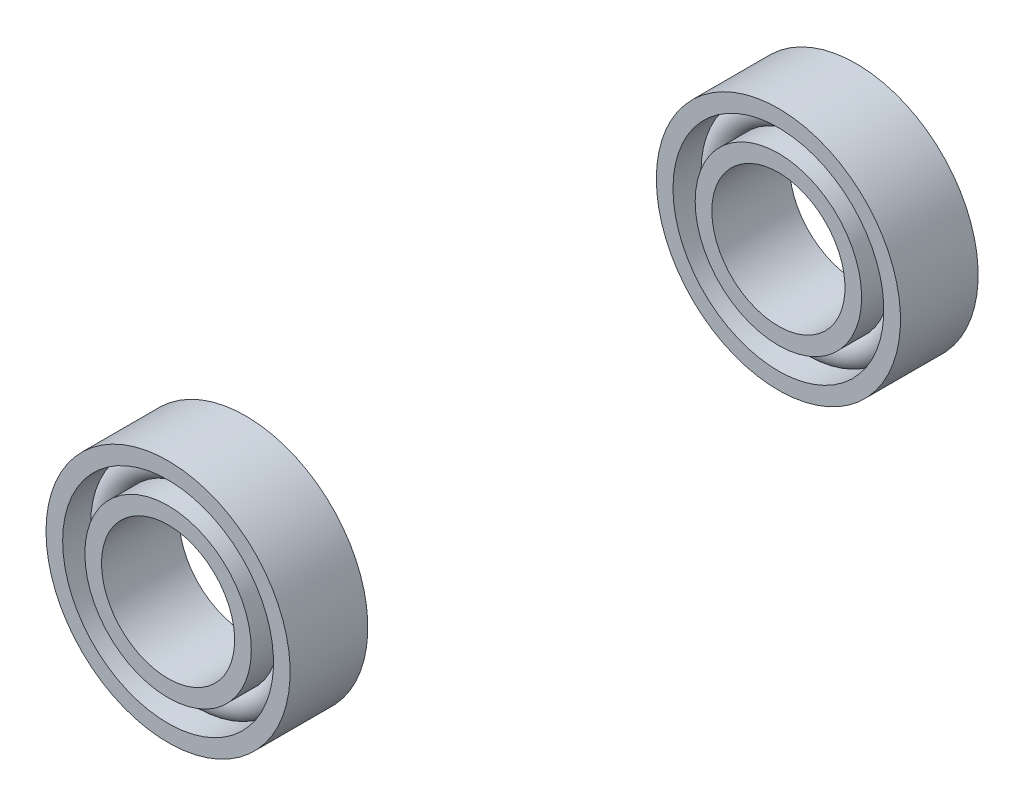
from build123d import *

# Parameters (mm, degrees)
SK_PISTA_INT_1_W = 1.5
SK_PISTA_INT_1_H = 7
SK_PISTA_EXT_1_W = 1.5
SK_PISTA_EXT_1_H = 7
SK_BOLAS_1_R     = 1.4
SK_PISTA_INT_2_W = 1.5
SK_PISTA_INT_2_H = 7
SK_PISTA_EXT_2_W = 1.5
SK_PISTA_EXT_2_H = 7
SK_BOLAS_2_R     = 1.4


with BuildPart() as part:
    # Sk_Pista_int_1 → Pista_int_1 (revolve)
    with BuildSketch(Plane(origin=(0, 0, 0), x_dir=(1, 0, 0), z_dir=(0, 1, 0)), mode=Mode.PRIVATE) as pista_int_1_sk:
        with Locations((179.25, -88)):
            Rectangle(SK_PISTA_INT_1_W, SK_PISTA_INT_1_H)
    revolve(pista_int_1_sk.sketch.rotate(Axis((172.5, 0, 79.5), (0, 0, 1)), 180), axis=Axis((172.5, 0, 79.5), (0, 0, 1)))



with BuildPart() as body_2:
    # Sk_Pista_ext_1 → Pista_ext_1 (revolve)
    with BuildSketch(Plane(origin=(0, 0, 0), x_dir=(1, 0, 0), z_dir=(0, 1, 0)), mode=Mode.PRIVATE) as pista_ext_1_sk:
        with Locations((182.75, -88)):
            Rectangle(SK_PISTA_EXT_1_W, SK_PISTA_EXT_1_H)
    revolve(pista_ext_1_sk.sketch.rotate(Axis((172.5, 0, 79.5), (0, 0, 1)), 180), axis=Axis((172.5, 0, 79.5), (0, 0, 1)))


with BuildPart() as part_1:
    add(part.part)

    add(body_2.part)  # Bolas_1 merges body 2
    # Sk_Bolas_1 → Bolas_1 (revolve)
    with BuildSketch(Plane(origin=(0, 0, 0), x_dir=(1, 0, 0), z_dir=(0, 1, 0)), mode=Mode.PRIVATE) as bolas_1_sk:
        with Locations((181, -88)):
            Circle(SK_BOLAS_1_R)
    revolve(bolas_1_sk.sketch.rotate(Axis((172.5, 0, 83), (0, 0, 1)), 180), axis=Axis((172.5, 0, 83), (0, 0, 1)))


with BuildPart() as body_2_2:
    # Sk_Pista_int_2 → Pista_int_2 (revolve)
    with BuildSketch(Plane(origin=(0, 0, 0), x_dir=(1, 0, 0), z_dir=(0, 1, 0)), mode=Mode.PRIVATE) as pista_int_2_sk:
        with Locations((179.25, -143)):
            Rectangle(SK_PISTA_INT_2_W, SK_PISTA_INT_2_H)
    revolve(pista_int_2_sk.sketch.rotate(Axis((172.5, 0, 134.5), (0, 0, 1)), 180), axis=Axis((172.5, 0, 134.5), (0, 0, 1)))



with BuildPart() as body_3:
    # Sk_Pista_ext_2 → Pista_ext_2 (revolve)
    with BuildSketch(Plane(origin=(0, 0, 0), x_dir=(1, 0, 0), z_dir=(0, 1, 0)), mode=Mode.PRIVATE) as pista_ext_2_sk:
        with Locations((182.75, -143)):
            Rectangle(SK_PISTA_EXT_2_W, SK_PISTA_EXT_2_H)
    revolve(pista_ext_2_sk.sketch.rotate(Axis((172.5, 0, 134.5), (0, 0, 1)), 180), axis=Axis((172.5, 0, 134.5), (0, 0, 1)))


with BuildPart() as body_2_2_1:
    add(body_2_2.part)

    add(body_3.part)  # Bolas_2 merges body 3
    # Sk_Bolas_2 → Bolas_2 (revolve)
    with BuildSketch(Plane(origin=(0, 0, 0), x_dir=(1, 0, 0), z_dir=(0, 1, 0)), mode=Mode.PRIVATE) as bolas_2_sk:
        with Locations((181, -143)):
            Circle(SK_BOLAS_2_R)
    revolve(bolas_2_sk.sketch.rotate(Axis((172.5, 0, 138), (0, 0, 1)), 180), axis=Axis((172.5, 0, 138), (0, 0, 1)))


solid = Compound([part_1.part, body_2_2_1.part])
